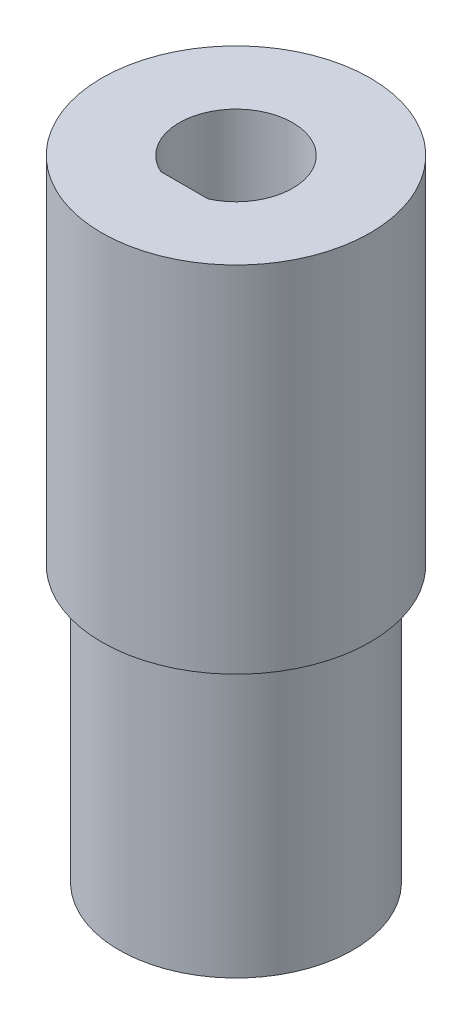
ISO-10303-21;
HEADER;
FILE_DESCRIPTION(('STEP AP214'),'2;1');
FILE_NAME('part.step','',(''),(''),'','','');
FILE_SCHEMA(('AUTOMOTIVE_DESIGN { 1 0 10303 214 1 1 1 1 }'));
ENDSEC;
DATA;
#1=APPLICATION_CONTEXT('core data for automotive mechanical design processes');
#2=APPLICATION_PROTOCOL_DEFINITION('international standard','automotive_design',2000,#1);
#3=PRODUCT_CONTEXT('',#1,'mechanical');
#4=PRODUCT('Part','Part','',(#3));
#5=PRODUCT_RELATED_PRODUCT_CATEGORY('part','',(#4));
#6=PRODUCT_DEFINITION_FORMATION('','',#4);
#7=PRODUCT_DEFINITION_CONTEXT('part definition',#1,'design');
#8=PRODUCT_DEFINITION('design','',#6,#7);
#9=PRODUCT_DEFINITION_SHAPE('','',#8);
#10=(LENGTH_UNIT() NAMED_UNIT(*) SI_UNIT(.MILLI.,.METRE.));
#11=(NAMED_UNIT(*) PLANE_ANGLE_UNIT() SI_UNIT($,.RADIAN.));
#12=(NAMED_UNIT(*) SI_UNIT($,.STERADIAN.) SOLID_ANGLE_UNIT());
#13=UNCERTAINTY_MEASURE_WITH_UNIT(LENGTH_MEASURE(1.E-05),#10,'distance_accuracy_value','');
#14=(GEOMETRIC_REPRESENTATION_CONTEXT(3) GLOBAL_UNCERTAINTY_ASSIGNED_CONTEXT((#13)) GLOBAL_UNIT_ASSIGNED_CONTEXT((#10,
#11,#12)) REPRESENTATION_CONTEXT('',''));
#15=CARTESIAN_POINT('',(0.,0.,0.));
#16=DIRECTION('',(0.,0.,1.));
#17=DIRECTION('',(1.,0.,0.));
#18=AXIS2_PLACEMENT_3D('',#15,#16,#17);
#19=CARTESIAN_POINT('',(0.,0.,0.));
#20=DIRECTION('',(0.,1.,0.));
#21=DIRECTION('',(0.,0.,1.));
#22=AXIS2_PLACEMENT_3D('',#19,#20,#21);
#23=PLANE('',#22);
#24=DIRECTION('',(0.,0.,-1.));
#25=VECTOR('',#24,1.);
#26=CARTESIAN_POINT('',(-0.849999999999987,0.,1.25000000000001));
#27=LINE('',#26,#25);
#28=CARTESIAN_POINT('',(-0.850000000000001,0.,2.29782505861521));
#29=VERTEX_POINT('',#28);
#30=CARTESIAN_POINT('',(-0.849999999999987,0.,1.25000000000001));
#31=VERTEX_POINT('',#30);
#32=EDGE_CURVE('E181',#29,#31,#27,.T.);
#33=ORIENTED_EDGE('',*,*,#32,.F.);
#34=CARTESIAN_POINT('',(0.,0.,0.));
#35=DIRECTION('',(0.,-1.,0.));
#36=DIRECTION('',(0.,0.,-1.));
#37=AXIS2_PLACEMENT_3D('',#34,#35,#36);
#38=CIRCLE('',#37,2.45);
#39=CARTESIAN_POINT('',(0.85,0.,2.29782505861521));
#40=VERTEX_POINT('',#39);
#41=EDGE_CURVE('E187',#40,#29,#38,.T.);
#42=ORIENTED_EDGE('',*,*,#41,.F.);
#43=DIRECTION('',(0.,0.,1.));
#44=VECTOR('',#43,1.);
#45=CARTESIAN_POINT('',(0.85,0.,2.29782505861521));
#46=LINE('',#45,#44);
#47=CARTESIAN_POINT('',(0.85,0.,1.25));
#48=VERTEX_POINT('',#47);
#49=EDGE_CURVE('E269',#48,#40,#46,.T.);
#50=ORIENTED_EDGE('',*,*,#49,.F.);
#51=CARTESIAN_POINT('',(1.25,0.,1.25));
#52=DIRECTION('',(0.,1.,0.));
#53=DIRECTION('',(0.,0.,-1.));
#54=AXIS2_PLACEMENT_3D('',#51,#52,#53);
#55=CIRCLE('',#54,0.4);
#56=CARTESIAN_POINT('',(1.25,0.,0.85));
#57=VERTEX_POINT('',#56);
#58=EDGE_CURVE('E266',#57,#48,#55,.T.);
#59=ORIENTED_EDGE('',*,*,#58,.F.);
#60=DIRECTION('',(-1.,0.,0.));
#61=VECTOR('',#60,1.);
#62=CARTESIAN_POINT('',(1.25,0.,0.85));
#63=LINE('',#62,#61);
#64=CARTESIAN_POINT('',(2.29782505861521,0.,0.85));
#65=VERTEX_POINT('',#64);
#66=EDGE_CURVE('E263',#65,#57,#63,.T.);
#67=ORIENTED_EDGE('',*,*,#66,.F.);
#68=CARTESIAN_POINT('',(0.,0.,0.));
#69=DIRECTION('',(0.,-1.,0.));
#70=DIRECTION('',(0.,0.,-1.));
#71=AXIS2_PLACEMENT_3D('',#68,#69,#70);
#72=CIRCLE('',#71,2.45);
#73=CARTESIAN_POINT('',(2.29782505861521,0.,-0.85));
#74=VERTEX_POINT('',#73);
#75=EDGE_CURVE('E260',#74,#65,#72,.T.);
#76=ORIENTED_EDGE('',*,*,#75,.F.);
#77=DIRECTION('',(1.,0.,0.));
#78=VECTOR('',#77,1.);
#79=CARTESIAN_POINT('',(2.29782505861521,0.,-0.85));
#80=LINE('',#79,#78);
#81=CARTESIAN_POINT('',(1.25,0.,-0.850000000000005));
#82=VERTEX_POINT('',#81);
#83=EDGE_CURVE('E257',#82,#74,#80,.T.);
#84=ORIENTED_EDGE('',*,*,#83,.F.);
#85=CARTESIAN_POINT('',(1.25,0.,-1.25));
#86=DIRECTION('',(0.,1.,0.));
#87=DIRECTION('',(0.,0.,-1.));
#88=AXIS2_PLACEMENT_3D('',#85,#86,#87);
#89=CIRCLE('',#88,0.4);
#90=CARTESIAN_POINT('',(0.849999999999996,0.,-1.25000000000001));
#91=VERTEX_POINT('',#90);
#92=EDGE_CURVE('E254',#91,#82,#89,.T.);
#93=ORIENTED_EDGE('',*,*,#92,.F.);
#94=DIRECTION('',(0.,0.,1.));
#95=VECTOR('',#94,1.);
#96=CARTESIAN_POINT('',(0.849999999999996,0.,-1.25000000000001));
#97=LINE('',#96,#95);
#98=CARTESIAN_POINT('',(0.85,0.,-2.29782505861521));
#99=VERTEX_POINT('',#98);
#100=EDGE_CURVE('E251',#99,#91,#97,.T.);
#101=ORIENTED_EDGE('',*,*,#100,.F.);
#102=CARTESIAN_POINT('',(0.,0.,0.));
#103=DIRECTION('',(0.,-1.,0.));
#104=DIRECTION('',(0.,0.,-1.));
#105=AXIS2_PLACEMENT_3D('',#102,#103,#104);
#106=CIRCLE('',#105,2.45);
#107=CARTESIAN_POINT('',(-0.85,0.,-2.29782505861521));
#108=VERTEX_POINT('',#107);
#109=EDGE_CURVE('E248',#108,#99,#106,.T.);
#110=ORIENTED_EDGE('',*,*,#109,.F.);
#111=DIRECTION('',(0.,0.,-1.));
#112=VECTOR('',#111,1.);
#113=CARTESIAN_POINT('',(-0.85,0.,-2.29782505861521));
#114=LINE('',#113,#112);
#115=CARTESIAN_POINT('',(-0.850000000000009,0.,-1.25));
#116=VERTEX_POINT('',#115);
#117=EDGE_CURVE('E245',#116,#108,#114,.T.);
#118=ORIENTED_EDGE('',*,*,#117,.F.);
#119=CARTESIAN_POINT('',(-1.25000000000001,0.,-1.24999999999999));
#120=DIRECTION('',(0.,1.,0.));
#121=DIRECTION('',(0.,0.,-1.));
#122=AXIS2_PLACEMENT_3D('',#119,#120,#121);
#123=CIRCLE('',#122,0.4);
#124=CARTESIAN_POINT('',(-1.25000000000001,0.,-0.849999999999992));
#125=VERTEX_POINT('',#124);
#126=EDGE_CURVE('E242',#125,#116,#123,.T.);
#127=ORIENTED_EDGE('',*,*,#126,.F.);
#128=DIRECTION('',(1.,0.,0.));
#129=VECTOR('',#128,1.);
#130=CARTESIAN_POINT('',(-1.25000000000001,0.,-0.849999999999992));
#131=LINE('',#130,#129);
#132=CARTESIAN_POINT('',(-2.29782505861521,0.,-0.85));
#133=VERTEX_POINT('',#132);
#134=EDGE_CURVE('E239',#133,#125,#131,.T.);
#135=ORIENTED_EDGE('',*,*,#134,.F.);
#136=CARTESIAN_POINT('',(0.,0.,0.));
#137=DIRECTION('',(0.,-1.,0.));
#138=DIRECTION('',(0.,0.,-1.));
#139=AXIS2_PLACEMENT_3D('',#136,#137,#138);
#140=CIRCLE('',#139,2.45);
#141=CARTESIAN_POINT('',(-2.29782505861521,0.,0.85));
#142=VERTEX_POINT('',#141);
#143=EDGE_CURVE('E236',#142,#133,#140,.T.);
#144=ORIENTED_EDGE('',*,*,#143,.F.);
#145=DIRECTION('',(-1.,0.,0.));
#146=VECTOR('',#145,1.);
#147=CARTESIAN_POINT('',(-2.29782505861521,0.,0.85));
#148=LINE('',#147,#146);
#149=CARTESIAN_POINT('',(-1.24999999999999,0.,0.850000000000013));
#150=VERTEX_POINT('',#149);
#151=EDGE_CURVE('E233',#150,#142,#148,.T.);
#152=ORIENTED_EDGE('',*,*,#151,.F.);
#153=CARTESIAN_POINT('',(-1.24999999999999,0.,1.25000000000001));
#154=DIRECTION('',(0.,1.,0.));
#155=DIRECTION('',(0.,0.,-1.));
#156=AXIS2_PLACEMENT_3D('',#153,#154,#155);
#157=CIRCLE('',#156,0.4);
#158=EDGE_CURVE('E230',#31,#150,#157,.T.);
#159=ORIENTED_EDGE('',*,*,#158,.F.);
#160=EDGE_LOOP('',(#33,#42,#50,#59,#67,#76,#84,#93,#101,#110,#118,#127,#135,#144,#152,#159));
#161=FACE_BOUND('',#160,.T.);
#162=CARTESIAN_POINT('',(0.,0.,0.));
#163=DIRECTION('',(0.,-1.,0.));
#164=DIRECTION('',(0.,0.,-1.));
#165=AXIS2_PLACEMENT_3D('',#162,#163,#164);
#166=CIRCLE('',#165,3.4);
#167=CARTESIAN_POINT('',(0.,0.,-3.4));
#168=VERTEX_POINT('',#167);
#169=EDGE_CURVE('E11',#168,#168,#166,.T.);
#170=ORIENTED_EDGE('',*,*,#169,.T.);
#171=EDGE_LOOP('',(#170));
#172=FACE_BOUND('',#171,.T.);
#173=ADVANCED_FACE('F37',(#161,#172),#23,.F.);
#174=CARTESIAN_POINT('',(0.,0.,0.));
#175=DIRECTION('',(0.,-1.,0.));
#176=DIRECTION('',(0.,0.,-1.));
#177=AXIS2_PLACEMENT_3D('',#174,#175,#176);
#178=CYLINDRICAL_SURFACE('',#177,3.4);
#179=ORIENTED_EDGE('',*,*,#169,.F.);
#180=EDGE_LOOP('',(#179));
#181=FACE_BOUND('',#180,.T.);
#182=CARTESIAN_POINT('',(0.,8.,0.));
#183=DIRECTION('',(0.,-1.,0.));
#184=DIRECTION('',(0.,0.,-1.));
#185=AXIS2_PLACEMENT_3D('',#182,#183,#184);
#186=CIRCLE('',#185,3.4);
#187=CARTESIAN_POINT('',(0.,8.,-3.4));
#188=VERTEX_POINT('',#187);
#189=EDGE_CURVE('E44',#188,#188,#186,.T.);
#190=ORIENTED_EDGE('',*,*,#189,.T.);
#191=EDGE_LOOP('',(#190));
#192=FACE_BOUND('',#191,.T.);
#193=ADVANCED_FACE('F312',(#181,#192),#178,.T.);
#194=CARTESIAN_POINT('',(-3.4,8.,0.));
#195=DIRECTION('',(0.,1.,0.));
#196=DIRECTION('',(0.,0.,1.));
#197=AXIS2_PLACEMENT_3D('',#194,#195,#196);
#198=PLANE('',#197);
#199=ORIENTED_EDGE('',*,*,#189,.F.);
#200=EDGE_LOOP('',(#199));
#201=FACE_BOUND('',#200,.T.);
#202=CARTESIAN_POINT('',(0.,8.,0.));
#203=DIRECTION('',(0.,-1.,0.));
#204=DIRECTION('',(0.,0.,-1.));
#205=AXIS2_PLACEMENT_3D('',#202,#203,#204);
#206=CIRCLE('',#205,3.9);
#207=CARTESIAN_POINT('',(0.,8.,-3.9));
#208=VERTEX_POINT('',#207);
#209=EDGE_CURVE('E307',#208,#208,#206,.T.);
#210=ORIENTED_EDGE('',*,*,#209,.T.);
#211=EDGE_LOOP('',(#210));
#212=FACE_BOUND('',#211,.T.);
#213=ADVANCED_FACE('F314',(#201,#212),#198,.F.);
#214=CARTESIAN_POINT('',(0.,0.,0.));
#215=DIRECTION('',(0.,-1.,0.));
#216=DIRECTION('',(0.,0.,-1.));
#217=AXIS2_PLACEMENT_3D('',#214,#215,#216);
#218=CYLINDRICAL_SURFACE('',#217,3.9);
#219=ORIENTED_EDGE('',*,*,#209,.F.);
#220=EDGE_LOOP('',(#219));
#221=FACE_BOUND('',#220,.T.);
#222=CARTESIAN_POINT('',(0.,18.3,0.));
#223=DIRECTION('',(0.,-1.,0.));
#224=DIRECTION('',(0.,0.,-1.));
#225=AXIS2_PLACEMENT_3D('',#222,#223,#224);
#226=CIRCLE('',#225,3.9);
#227=CARTESIAN_POINT('',(0.,18.3,-3.9));
#228=VERTEX_POINT('',#227);
#229=EDGE_CURVE('E275',#228,#228,#226,.T.);
#230=ORIENTED_EDGE('',*,*,#229,.T.);
#231=EDGE_LOOP('',(#230));
#232=FACE_BOUND('',#231,.T.);
#233=ADVANCED_FACE('F317',(#221,#232),#218,.T.);
#234=CARTESIAN_POINT('',(-3.9,18.3,0.));
#235=DIRECTION('',(0.,-1.,0.));
#236=DIRECTION('',(0.,0.,-1.));
#237=AXIS2_PLACEMENT_3D('',#234,#235,#236);
#238=PLANE('',#237);
#239=DIRECTION('',(1.,0.,0.));
#240=VECTOR('',#239,1.);
#241=CARTESIAN_POINT('',(-0.687386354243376,18.3,1.5));
#242=LINE('',#241,#240);
#243=CARTESIAN_POINT('',(-0.687386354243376,18.3,1.5));
#244=VERTEX_POINT('',#243);
#245=CARTESIAN_POINT('',(0.687386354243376,18.3,1.5));
#246=VERTEX_POINT('',#245);
#247=EDGE_CURVE('E174',#244,#246,#242,.T.);
#248=ORIENTED_EDGE('',*,*,#247,.F.);
#249=CARTESIAN_POINT('',(0.,18.3,0.));
#250=DIRECTION('',(0.,1.,0.));
#251=DIRECTION('',(0.,0.,1.));
#252=AXIS2_PLACEMENT_3D('',#249,#250,#251);
#253=CIRCLE('',#252,1.65);
#254=EDGE_CURVE('E51',#246,#244,#253,.T.);
#255=ORIENTED_EDGE('',*,*,#254,.F.);
#256=EDGE_LOOP('',(#248,#255));
#257=FACE_BOUND('',#256,.T.);
#258=ORIENTED_EDGE('',*,*,#229,.F.);
#259=EDGE_LOOP('',(#258));
#260=FACE_BOUND('',#259,.T.);
#261=ADVANCED_FACE('F323',(#257,#260),#238,.F.);
#262=CARTESIAN_POINT('',(0.,8.,0.));
#263=DIRECTION('',(0.,-1.,0.));
#264=DIRECTION('',(0.,0.,-1.));
#265=AXIS2_PLACEMENT_3D('',#262,#263,#264);
#266=CYLINDRICAL_SURFACE('',#265,2.45);
#267=ORIENTED_EDGE('',*,*,#41,.T.);
#268=DIRECTION('',(0.,-1.,0.));
#269=VECTOR('',#268,1.);
#270=CARTESIAN_POINT('',(-0.850000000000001,8.,2.29782505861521));
#271=LINE('',#270,#269);
#272=CARTESIAN_POINT('',(-0.850000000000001,8.,2.29782505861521));
#273=VERTEX_POINT('',#272);
#274=EDGE_CURVE('E59',#273,#29,#271,.T.);
#275=ORIENTED_EDGE('',*,*,#274,.F.);
#276=CARTESIAN_POINT('',(0.,8.,0.));
#277=DIRECTION('',(0.,-1.,0.));
#278=DIRECTION('',(0.,0.,-1.));
#279=AXIS2_PLACEMENT_3D('',#276,#277,#278);
#280=CIRCLE('',#279,2.45);
#281=CARTESIAN_POINT('',(0.85,8.,2.29782505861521));
#282=VERTEX_POINT('',#281);
#283=EDGE_CURVE('E183',#282,#273,#280,.T.);
#284=ORIENTED_EDGE('',*,*,#283,.F.);
#285=DIRECTION('',(0.,-1.,0.));
#286=VECTOR('',#285,1.);
#287=CARTESIAN_POINT('',(0.85,8.,2.29782505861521));
#288=LINE('',#287,#286);
#289=EDGE_CURVE('E273',#282,#40,#288,.T.);
#290=ORIENTED_EDGE('',*,*,#289,.T.);
#291=EDGE_LOOP('',(#267,#275,#284,#290));
#292=FACE_BOUND('',#291,.T.);
#293=ADVANCED_FACE('F328',(#292),#266,.F.);
#294=CARTESIAN_POINT('',(0.85,8.,2.29782505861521));
#295=DIRECTION('',(1.,0.,0.));
#296=DIRECTION('',(0.,0.,-1.));
#297=AXIS2_PLACEMENT_3D('',#294,#295,#296);
#298=PLANE('',#297);
#299=ORIENTED_EDGE('',*,*,#49,.T.);
#300=ORIENTED_EDGE('',*,*,#289,.F.);
#301=DIRECTION('',(0.,0.,1.));
#302=VECTOR('',#301,1.);
#303=CARTESIAN_POINT('',(0.85,8.,2.29782505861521));
#304=LINE('',#303,#302);
#305=CARTESIAN_POINT('',(0.85,8.,1.25));
#306=VERTEX_POINT('',#305);
#307=EDGE_CURVE('E226',#306,#282,#304,.T.);
#308=ORIENTED_EDGE('',*,*,#307,.F.);
#309=DIRECTION('',(0.,-1.,0.));
#310=VECTOR('',#309,1.);
#311=CARTESIAN_POINT('',(0.85,8.,1.25));
#312=LINE('',#311,#310);
#313=EDGE_CURVE('E276',#306,#48,#312,.T.);
#314=ORIENTED_EDGE('',*,*,#313,.T.);
#315=EDGE_LOOP('',(#299,#300,#308,#314));
#316=FACE_BOUND('',#315,.T.);
#317=ADVANCED_FACE('F334',(#316),#298,.F.);
#318=CARTESIAN_POINT('',(1.25,8.,1.25));
#319=DIRECTION('',(0.,-1.,0.));
#320=DIRECTION('',(0.,0.,-1.));
#321=AXIS2_PLACEMENT_3D('',#318,#319,#320);
#322=CYLINDRICAL_SURFACE('',#321,0.4);
#323=ORIENTED_EDGE('',*,*,#58,.T.);
#324=ORIENTED_EDGE('',*,*,#313,.F.);
#325=CARTESIAN_POINT('',(1.25,8.,1.25));
#326=DIRECTION('',(0.,1.,0.));
#327=DIRECTION('',(0.,0.,-1.));
#328=AXIS2_PLACEMENT_3D('',#325,#326,#327);
#329=CIRCLE('',#328,0.4);
#330=CARTESIAN_POINT('',(1.25,8.,0.85));
#331=VERTEX_POINT('',#330);
#332=EDGE_CURVE('E223',#331,#306,#329,.T.);
#333=ORIENTED_EDGE('',*,*,#332,.F.);
#334=DIRECTION('',(0.,-1.,0.));
#335=VECTOR('',#334,1.);
#336=CARTESIAN_POINT('',(1.25,8.,0.85));
#337=LINE('',#336,#335);
#338=EDGE_CURVE('E278',#331,#57,#337,.T.);
#339=ORIENTED_EDGE('',*,*,#338,.T.);
#340=EDGE_LOOP('',(#323,#324,#333,#339));
#341=FACE_BOUND('',#340,.T.);
#342=ADVANCED_FACE('F365',(#341),#322,.T.);
#343=CARTESIAN_POINT('',(1.25,8.,0.85));
#344=DIRECTION('',(0.,0.,1.));
#345=DIRECTION('',(1.,0.,0.));
#346=AXIS2_PLACEMENT_3D('',#343,#344,#345);
#347=PLANE('',#346);
#348=ORIENTED_EDGE('',*,*,#66,.T.);
#349=ORIENTED_EDGE('',*,*,#338,.F.);
#350=DIRECTION('',(-1.,0.,0.));
#351=VECTOR('',#350,1.);
#352=CARTESIAN_POINT('',(1.25,8.,0.85));
#353=LINE('',#352,#351);
#354=CARTESIAN_POINT('',(2.29782505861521,8.,0.85));
#355=VERTEX_POINT('',#354);
#356=EDGE_CURVE('E220',#355,#331,#353,.T.);
#357=ORIENTED_EDGE('',*,*,#356,.F.);
#358=DIRECTION('',(0.,-1.,0.));
#359=VECTOR('',#358,1.);
#360=CARTESIAN_POINT('',(2.29782505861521,8.,0.85));
#361=LINE('',#360,#359);
#362=EDGE_CURVE('E280',#355,#65,#361,.T.);
#363=ORIENTED_EDGE('',*,*,#362,.T.);
#364=EDGE_LOOP('',(#348,#349,#357,#363));
#365=FACE_BOUND('',#364,.T.);
#366=ADVANCED_FACE('F369',(#365),#347,.F.);
#367=CARTESIAN_POINT('',(0.,8.,0.));
#368=DIRECTION('',(0.,-1.,0.));
#369=DIRECTION('',(0.,0.,-1.));
#370=AXIS2_PLACEMENT_3D('',#367,#368,#369);
#371=CYLINDRICAL_SURFACE('',#370,2.45);
#372=ORIENTED_EDGE('',*,*,#75,.T.);
#373=ORIENTED_EDGE('',*,*,#362,.F.);
#374=CARTESIAN_POINT('',(0.,8.,0.));
#375=DIRECTION('',(0.,-1.,0.));
#376=DIRECTION('',(0.,0.,-1.));
#377=AXIS2_PLACEMENT_3D('',#374,#375,#376);
#378=CIRCLE('',#377,2.45);
#379=CARTESIAN_POINT('',(2.29782505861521,8.,-0.85));
#380=VERTEX_POINT('',#379);
#381=EDGE_CURVE('E218',#380,#355,#378,.T.);
#382=ORIENTED_EDGE('',*,*,#381,.F.);
#383=DIRECTION('',(0.,-1.,0.));
#384=VECTOR('',#383,1.);
#385=CARTESIAN_POINT('',(2.29782505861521,8.,-0.85));
#386=LINE('',#385,#384);
#387=EDGE_CURVE('E282',#380,#74,#386,.T.);
#388=ORIENTED_EDGE('',*,*,#387,.T.);
#389=EDGE_LOOP('',(#372,#373,#382,#388));
#390=FACE_BOUND('',#389,.T.);
#391=ADVANCED_FACE('F373',(#390),#371,.F.);
#392=CARTESIAN_POINT('',(2.29782505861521,8.,-0.85));
#393=DIRECTION('',(0.,0.,-1.));
#394=DIRECTION('',(-1.,0.,0.));
#395=AXIS2_PLACEMENT_3D('',#392,#393,#394);
#396=PLANE('',#395);
#397=ORIENTED_EDGE('',*,*,#83,.T.);
#398=ORIENTED_EDGE('',*,*,#387,.F.);
#399=DIRECTION('',(1.,0.,0.));
#400=VECTOR('',#399,1.);
#401=CARTESIAN_POINT('',(2.29782505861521,8.,-0.85));
#402=LINE('',#401,#400);
#403=CARTESIAN_POINT('',(1.25,8.,-0.850000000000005));
#404=VERTEX_POINT('',#403);
#405=EDGE_CURVE('E215',#404,#380,#402,.T.);
#406=ORIENTED_EDGE('',*,*,#405,.F.);
#407=DIRECTION('',(0.,-1.,0.));
#408=VECTOR('',#407,1.);
#409=CARTESIAN_POINT('',(1.25,8.,-0.850000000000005));
#410=LINE('',#409,#408);
#411=EDGE_CURVE('E284',#404,#82,#410,.T.);
#412=ORIENTED_EDGE('',*,*,#411,.T.);
#413=EDGE_LOOP('',(#397,#398,#406,#412));
#414=FACE_BOUND('',#413,.T.);
#415=ADVANCED_FACE('F378',(#414),#396,.F.);
#416=CARTESIAN_POINT('',(1.25,8.,-1.25));
#417=DIRECTION('',(0.,-1.,0.));
#418=DIRECTION('',(0.,0.,-1.));
#419=AXIS2_PLACEMENT_3D('',#416,#417,#418);
#420=CYLINDRICAL_SURFACE('',#419,0.4);
#421=ORIENTED_EDGE('',*,*,#92,.T.);
#422=ORIENTED_EDGE('',*,*,#411,.F.);
#423=CARTESIAN_POINT('',(1.25,8.,-1.25));
#424=DIRECTION('',(0.,1.,0.));
#425=DIRECTION('',(0.,0.,-1.));
#426=AXIS2_PLACEMENT_3D('',#423,#424,#425);
#427=CIRCLE('',#426,0.4);
#428=CARTESIAN_POINT('',(0.849999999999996,8.,-1.25000000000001));
#429=VERTEX_POINT('',#428);
#430=EDGE_CURVE('E212',#429,#404,#427,.T.);
#431=ORIENTED_EDGE('',*,*,#430,.F.);
#432=DIRECTION('',(0.,-1.,0.));
#433=VECTOR('',#432,1.);
#434=CARTESIAN_POINT('',(0.849999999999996,8.,-1.25000000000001));
#435=LINE('',#434,#433);
#436=EDGE_CURVE('E286',#429,#91,#435,.T.);
#437=ORIENTED_EDGE('',*,*,#436,.T.);
#438=EDGE_LOOP('',(#421,#422,#431,#437));
#439=FACE_BOUND('',#438,.T.);
#440=ADVANCED_FACE('F382',(#439),#420,.T.);
#441=CARTESIAN_POINT('',(0.849999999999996,8.,-1.25000000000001));
#442=DIRECTION('',(1.,0.,0.));
#443=DIRECTION('',(0.,0.,-1.));
#444=AXIS2_PLACEMENT_3D('',#441,#442,#443);
#445=PLANE('',#444);
#446=ORIENTED_EDGE('',*,*,#100,.T.);
#447=ORIENTED_EDGE('',*,*,#436,.F.);
#448=DIRECTION('',(0.,0.,1.));
#449=VECTOR('',#448,1.);
#450=CARTESIAN_POINT('',(0.849999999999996,8.,-1.25000000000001));
#451=LINE('',#450,#449);
#452=CARTESIAN_POINT('',(0.85,8.,-2.29782505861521));
#453=VERTEX_POINT('',#452);
#454=EDGE_CURVE('E209',#453,#429,#451,.T.);
#455=ORIENTED_EDGE('',*,*,#454,.F.);
#456=DIRECTION('',(0.,-1.,0.));
#457=VECTOR('',#456,1.);
#458=CARTESIAN_POINT('',(0.85,8.,-2.29782505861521));
#459=LINE('',#458,#457);
#460=EDGE_CURVE('E288',#453,#99,#459,.T.);
#461=ORIENTED_EDGE('',*,*,#460,.T.);
#462=EDGE_LOOP('',(#446,#447,#455,#461));
#463=FACE_BOUND('',#462,.T.);
#464=ADVANCED_FACE('F385',(#463),#445,.F.);
#465=CARTESIAN_POINT('',(0.,8.,0.));
#466=DIRECTION('',(0.,-1.,0.));
#467=DIRECTION('',(0.,0.,-1.));
#468=AXIS2_PLACEMENT_3D('',#465,#466,#467);
#469=CYLINDRICAL_SURFACE('',#468,2.45);
#470=ORIENTED_EDGE('',*,*,#109,.T.);
#471=ORIENTED_EDGE('',*,*,#460,.F.);
#472=CARTESIAN_POINT('',(0.,8.,0.));
#473=DIRECTION('',(0.,-1.,0.));
#474=DIRECTION('',(0.,0.,-1.));
#475=AXIS2_PLACEMENT_3D('',#472,#473,#474);
#476=CIRCLE('',#475,2.45);
#477=CARTESIAN_POINT('',(-0.85,8.,-2.29782505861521));
#478=VERTEX_POINT('',#477);
#479=EDGE_CURVE('E207',#478,#453,#476,.T.);
#480=ORIENTED_EDGE('',*,*,#479,.F.);
#481=DIRECTION('',(0.,-1.,0.));
#482=VECTOR('',#481,1.);
#483=CARTESIAN_POINT('',(-0.85,8.,-2.29782505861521));
#484=LINE('',#483,#482);
#485=EDGE_CURVE('E290',#478,#108,#484,.T.);
#486=ORIENTED_EDGE('',*,*,#485,.T.);
#487=EDGE_LOOP('',(#470,#471,#480,#486));
#488=FACE_BOUND('',#487,.T.);
#489=ADVANCED_FACE('F391',(#488),#469,.F.);
#490=CARTESIAN_POINT('',(-0.85,8.,-2.29782505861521));
#491=DIRECTION('',(-1.,0.,0.));
#492=DIRECTION('',(0.,0.,1.));
#493=AXIS2_PLACEMENT_3D('',#490,#491,#492);
#494=PLANE('',#493);
#495=ORIENTED_EDGE('',*,*,#117,.T.);
#496=ORIENTED_EDGE('',*,*,#485,.F.);
#497=DIRECTION('',(0.,0.,-1.));
#498=VECTOR('',#497,1.);
#499=CARTESIAN_POINT('',(-0.85,8.,-2.29782505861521));
#500=LINE('',#499,#498);
#501=CARTESIAN_POINT('',(-0.850000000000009,8.,-1.25));
#502=VERTEX_POINT('',#501);
#503=EDGE_CURVE('E204',#502,#478,#500,.T.);
#504=ORIENTED_EDGE('',*,*,#503,.F.);
#505=DIRECTION('',(0.,-1.,0.));
#506=VECTOR('',#505,1.);
#507=CARTESIAN_POINT('',(-0.850000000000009,8.,-1.25));
#508=LINE('',#507,#506);
#509=EDGE_CURVE('E292',#502,#116,#508,.T.);
#510=ORIENTED_EDGE('',*,*,#509,.T.);
#511=EDGE_LOOP('',(#495,#496,#504,#510));
#512=FACE_BOUND('',#511,.T.);
#513=ADVANCED_FACE('F395',(#512),#494,.F.);
#514=CARTESIAN_POINT('',(-1.25000000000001,8.,-1.24999999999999));
#515=DIRECTION('',(0.,-1.,0.));
#516=DIRECTION('',(0.,0.,-1.));
#517=AXIS2_PLACEMENT_3D('',#514,#515,#516);
#518=CYLINDRICAL_SURFACE('',#517,0.4);
#519=ORIENTED_EDGE('',*,*,#126,.T.);
#520=ORIENTED_EDGE('',*,*,#509,.F.);
#521=CARTESIAN_POINT('',(-1.25000000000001,8.,-1.24999999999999));
#522=DIRECTION('',(0.,1.,0.));
#523=DIRECTION('',(0.,0.,-1.));
#524=AXIS2_PLACEMENT_3D('',#521,#522,#523);
#525=CIRCLE('',#524,0.4);
#526=CARTESIAN_POINT('',(-1.25000000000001,8.,-0.849999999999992));
#527=VERTEX_POINT('',#526);
#528=EDGE_CURVE('E201',#527,#502,#525,.T.);
#529=ORIENTED_EDGE('',*,*,#528,.F.);
#530=DIRECTION('',(0.,-1.,0.));
#531=VECTOR('',#530,1.);
#532=CARTESIAN_POINT('',(-1.25000000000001,8.,-0.849999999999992));
#533=LINE('',#532,#531);
#534=EDGE_CURVE('E294',#527,#125,#533,.T.);
#535=ORIENTED_EDGE('',*,*,#534,.T.);
#536=EDGE_LOOP('',(#519,#520,#529,#535));
#537=FACE_BOUND('',#536,.T.);
#538=ADVANCED_FACE('F398',(#537),#518,.T.);
#539=CARTESIAN_POINT('',(-1.25000000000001,8.,-0.849999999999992));
#540=DIRECTION('',(0.,0.,-1.));
#541=DIRECTION('',(-1.,0.,0.));
#542=AXIS2_PLACEMENT_3D('',#539,#540,#541);
#543=PLANE('',#542);
#544=ORIENTED_EDGE('',*,*,#134,.T.);
#545=ORIENTED_EDGE('',*,*,#534,.F.);
#546=DIRECTION('',(1.,0.,0.));
#547=VECTOR('',#546,1.);
#548=CARTESIAN_POINT('',(-1.25000000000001,8.,-0.849999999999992));
#549=LINE('',#548,#547);
#550=CARTESIAN_POINT('',(-2.29782505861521,8.,-0.85));
#551=VERTEX_POINT('',#550);
#552=EDGE_CURVE('E198',#551,#527,#549,.T.);
#553=ORIENTED_EDGE('',*,*,#552,.F.);
#554=DIRECTION('',(0.,-1.,0.));
#555=VECTOR('',#554,1.);
#556=CARTESIAN_POINT('',(-2.29782505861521,8.,-0.85));
#557=LINE('',#556,#555);
#558=EDGE_CURVE('E296',#551,#133,#557,.T.);
#559=ORIENTED_EDGE('',*,*,#558,.T.);
#560=EDGE_LOOP('',(#544,#545,#553,#559));
#561=FACE_BOUND('',#560,.T.);
#562=ADVANCED_FACE('F402',(#561),#543,.F.);
#563=CARTESIAN_POINT('',(0.,8.,0.));
#564=DIRECTION('',(0.,-1.,0.));
#565=DIRECTION('',(0.,0.,-1.));
#566=AXIS2_PLACEMENT_3D('',#563,#564,#565);
#567=CYLINDRICAL_SURFACE('',#566,2.45);
#568=ORIENTED_EDGE('',*,*,#143,.T.);
#569=ORIENTED_EDGE('',*,*,#558,.F.);
#570=CARTESIAN_POINT('',(0.,8.,0.));
#571=DIRECTION('',(0.,-1.,0.));
#572=DIRECTION('',(0.,0.,-1.));
#573=AXIS2_PLACEMENT_3D('',#570,#571,#572);
#574=CIRCLE('',#573,2.45);
#575=CARTESIAN_POINT('',(-2.29782505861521,8.,0.85));
#576=VERTEX_POINT('',#575);
#577=EDGE_CURVE('E196',#576,#551,#574,.T.);
#578=ORIENTED_EDGE('',*,*,#577,.F.);
#579=DIRECTION('',(0.,-1.,0.));
#580=VECTOR('',#579,1.);
#581=CARTESIAN_POINT('',(-2.29782505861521,8.,0.85));
#582=LINE('',#581,#580);
#583=EDGE_CURVE('E298',#576,#142,#582,.T.);
#584=ORIENTED_EDGE('',*,*,#583,.T.);
#585=EDGE_LOOP('',(#568,#569,#578,#584));
#586=FACE_BOUND('',#585,.T.);
#587=ADVANCED_FACE('F407',(#586),#567,.F.);
#588=CARTESIAN_POINT('',(-2.29782505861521,8.,0.85));
#589=DIRECTION('',(0.,0.,1.));
#590=DIRECTION('',(1.,0.,0.));
#591=AXIS2_PLACEMENT_3D('',#588,#589,#590);
#592=PLANE('',#591);
#593=ORIENTED_EDGE('',*,*,#151,.T.);
#594=ORIENTED_EDGE('',*,*,#583,.F.);
#595=DIRECTION('',(-1.,0.,0.));
#596=VECTOR('',#595,1.);
#597=CARTESIAN_POINT('',(-2.29782505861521,8.,0.85));
#598=LINE('',#597,#596);
#599=CARTESIAN_POINT('',(-1.24999999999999,8.,0.850000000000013));
#600=VERTEX_POINT('',#599);
#601=EDGE_CURVE('E193',#600,#576,#598,.T.);
#602=ORIENTED_EDGE('',*,*,#601,.F.);
#603=DIRECTION('',(0.,-1.,0.));
#604=VECTOR('',#603,1.);
#605=CARTESIAN_POINT('',(-1.24999999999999,8.,0.850000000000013));
#606=LINE('',#605,#604);
#607=EDGE_CURVE('E300',#600,#150,#606,.T.);
#608=ORIENTED_EDGE('',*,*,#607,.T.);
#609=EDGE_LOOP('',(#593,#594,#602,#608));
#610=FACE_BOUND('',#609,.T.);
#611=ADVANCED_FACE('F409',(#610),#592,.F.);
#612=CARTESIAN_POINT('',(-1.24999999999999,8.,1.25000000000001));
#613=DIRECTION('',(0.,-1.,0.));
#614=DIRECTION('',(0.,0.,-1.));
#615=AXIS2_PLACEMENT_3D('',#612,#613,#614);
#616=CYLINDRICAL_SURFACE('',#615,0.4);
#617=ORIENTED_EDGE('',*,*,#158,.T.);
#618=ORIENTED_EDGE('',*,*,#607,.F.);
#619=CARTESIAN_POINT('',(-1.24999999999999,8.,1.25000000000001));
#620=DIRECTION('',(0.,1.,0.));
#621=DIRECTION('',(0.,0.,-1.));
#622=AXIS2_PLACEMENT_3D('',#619,#620,#621);
#623=CIRCLE('',#622,0.4);
#624=CARTESIAN_POINT('',(-0.849999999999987,8.,1.25000000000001));
#625=VERTEX_POINT('',#624);
#626=EDGE_CURVE('E190',#625,#600,#623,.T.);
#627=ORIENTED_EDGE('',*,*,#626,.F.);
#628=DIRECTION('',(0.,-1.,0.));
#629=VECTOR('',#628,1.);
#630=CARTESIAN_POINT('',(-0.849999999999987,8.,1.25000000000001));
#631=LINE('',#630,#629);
#632=EDGE_CURVE('E302',#625,#31,#631,.T.);
#633=ORIENTED_EDGE('',*,*,#632,.T.);
#634=EDGE_LOOP('',(#617,#618,#627,#633));
#635=FACE_BOUND('',#634,.T.);
#636=ADVANCED_FACE('F354',(#635),#616,.T.);
#637=CARTESIAN_POINT('',(-0.849999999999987,8.,1.25000000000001));
#638=DIRECTION('',(-1.,0.,0.));
#639=DIRECTION('',(0.,0.,1.));
#640=AXIS2_PLACEMENT_3D('',#637,#638,#639);
#641=PLANE('',#640);
#642=ORIENTED_EDGE('',*,*,#32,.T.);
#643=ORIENTED_EDGE('',*,*,#632,.F.);
#644=DIRECTION('',(0.,0.,-1.));
#645=VECTOR('',#644,1.);
#646=CARTESIAN_POINT('',(-0.849999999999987,8.,1.25000000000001));
#647=LINE('',#646,#645);
#648=EDGE_CURVE('E186',#273,#625,#647,.T.);
#649=ORIENTED_EDGE('',*,*,#648,.F.);
#650=ORIENTED_EDGE('',*,*,#274,.T.);
#651=EDGE_LOOP('',(#642,#643,#649,#650));
#652=FACE_BOUND('',#651,.T.);
#653=ADVANCED_FACE('F351',(#652),#641,.F.);
#654=CARTESIAN_POINT('',(0.,8.,0.));
#655=DIRECTION('',(0.,-1.,0.));
#656=DIRECTION('',(0.,0.,-1.));
#657=AXIS2_PLACEMENT_3D('',#654,#655,#656);
#658=PLANE('',#657);
#659=ORIENTED_EDGE('',*,*,#283,.T.);
#660=ORIENTED_EDGE('',*,*,#648,.T.);
#661=ORIENTED_EDGE('',*,*,#626,.T.);
#662=ORIENTED_EDGE('',*,*,#601,.T.);
#663=ORIENTED_EDGE('',*,*,#577,.T.);
#664=ORIENTED_EDGE('',*,*,#552,.T.);
#665=ORIENTED_EDGE('',*,*,#528,.T.);
#666=ORIENTED_EDGE('',*,*,#503,.T.);
#667=ORIENTED_EDGE('',*,*,#479,.T.);
#668=ORIENTED_EDGE('',*,*,#454,.T.);
#669=ORIENTED_EDGE('',*,*,#430,.T.);
#670=ORIENTED_EDGE('',*,*,#405,.T.);
#671=ORIENTED_EDGE('',*,*,#381,.T.);
#672=ORIENTED_EDGE('',*,*,#356,.T.);
#673=ORIENTED_EDGE('',*,*,#332,.T.);
#674=ORIENTED_EDGE('',*,*,#307,.T.);
#675=EDGE_LOOP('',(#659,#660,#661,#662,#663,#664,#665,#666,#667,#668,#669,#670,#671,#672,#673,#674));
#676=FACE_BOUND('',#675,.T.);
#677=ADVANCED_FACE('F357',(#676),#658,.T.);
#678=CARTESIAN_POINT('',(0.,8.3,0.));
#679=DIRECTION('',(0.,1.,0.));
#680=DIRECTION('',(0.,0.,1.));
#681=AXIS2_PLACEMENT_3D('',#678,#679,#680);
#682=CYLINDRICAL_SURFACE('',#681,1.65);
#683=ORIENTED_EDGE('',*,*,#254,.T.);
#684=DIRECTION('',(0.,1.,0.));
#685=VECTOR('',#684,1.);
#686=CARTESIAN_POINT('',(-0.687386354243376,8.3,1.5));
#687=LINE('',#686,#685);
#688=CARTESIAN_POINT('',(-0.687386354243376,8.3,1.5));
#689=VERTEX_POINT('',#688);
#690=EDGE_CURVE('E160',#689,#244,#687,.T.);
#691=ORIENTED_EDGE('',*,*,#690,.F.);
#692=CARTESIAN_POINT('',(0.,8.3,0.));
#693=DIRECTION('',(0.,1.,0.));
#694=DIRECTION('',(0.,0.,1.));
#695=AXIS2_PLACEMENT_3D('',#692,#693,#694);
#696=CIRCLE('',#695,1.65);
#697=CARTESIAN_POINT('',(0.687386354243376,8.3,1.5));
#698=VERTEX_POINT('',#697);
#699=EDGE_CURVE('E163',#698,#689,#696,.T.);
#700=ORIENTED_EDGE('',*,*,#699,.F.);
#701=DIRECTION('',(0.,1.,0.));
#702=VECTOR('',#701,1.);
#703=CARTESIAN_POINT('',(0.687386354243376,8.3,1.5));
#704=LINE('',#703,#702);
#705=EDGE_CURVE('E169',#698,#246,#704,.T.);
#706=ORIENTED_EDGE('',*,*,#705,.T.);
#707=EDGE_LOOP('',(#683,#691,#700,#706));
#708=FACE_BOUND('',#707,.T.);
#709=ADVANCED_FACE('F162',(#708),#682,.F.);
#710=CARTESIAN_POINT('',(-0.687386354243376,8.3,1.5));
#711=DIRECTION('',(0.,0.,1.));
#712=DIRECTION('',(1.,0.,0.));
#713=AXIS2_PLACEMENT_3D('',#710,#711,#712);
#714=PLANE('',#713);
#715=ORIENTED_EDGE('',*,*,#247,.T.);
#716=ORIENTED_EDGE('',*,*,#705,.F.);
#717=DIRECTION('',(1.,0.,0.));
#718=VECTOR('',#717,1.);
#719=CARTESIAN_POINT('',(-0.687386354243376,8.3,1.5));
#720=LINE('',#719,#718);
#721=EDGE_CURVE('E170',#689,#698,#720,.T.);
#722=ORIENTED_EDGE('',*,*,#721,.F.);
#723=ORIENTED_EDGE('',*,*,#690,.T.);
#724=EDGE_LOOP('',(#715,#716,#722,#723));
#725=FACE_BOUND('',#724,.T.);
#726=ADVANCED_FACE('F176',(#725),#714,.F.);
#727=CARTESIAN_POINT('',(0.,8.3,0.));
#728=DIRECTION('',(0.,1.,0.));
#729=DIRECTION('',(0.,0.,1.));
#730=AXIS2_PLACEMENT_3D('',#727,#728,#729);
#731=PLANE('',#730);
#732=ORIENTED_EDGE('',*,*,#699,.T.);
#733=ORIENTED_EDGE('',*,*,#721,.T.);
#734=EDGE_LOOP('',(#732,#733));
#735=FACE_BOUND('',#734,.T.);
#736=ADVANCED_FACE('F173',(#735),#731,.T.);
#737=CLOSED_SHELL('',(#173,#193,#213,#233,#261,#293,#317,#342,#366,#391,#415,#440,#464,#489,
#513,#538,#562,#587,#611,#636,#653,#677,#709,#726,#736));
#738=MANIFOLD_SOLID_BREP('B2',#737);
#739=ADVANCED_BREP_SHAPE_REPRESENTATION('',(#18,#738),#14);
#740=SHAPE_DEFINITION_REPRESENTATION(#9,#739);
ENDSEC;
END-ISO-10303-21;
